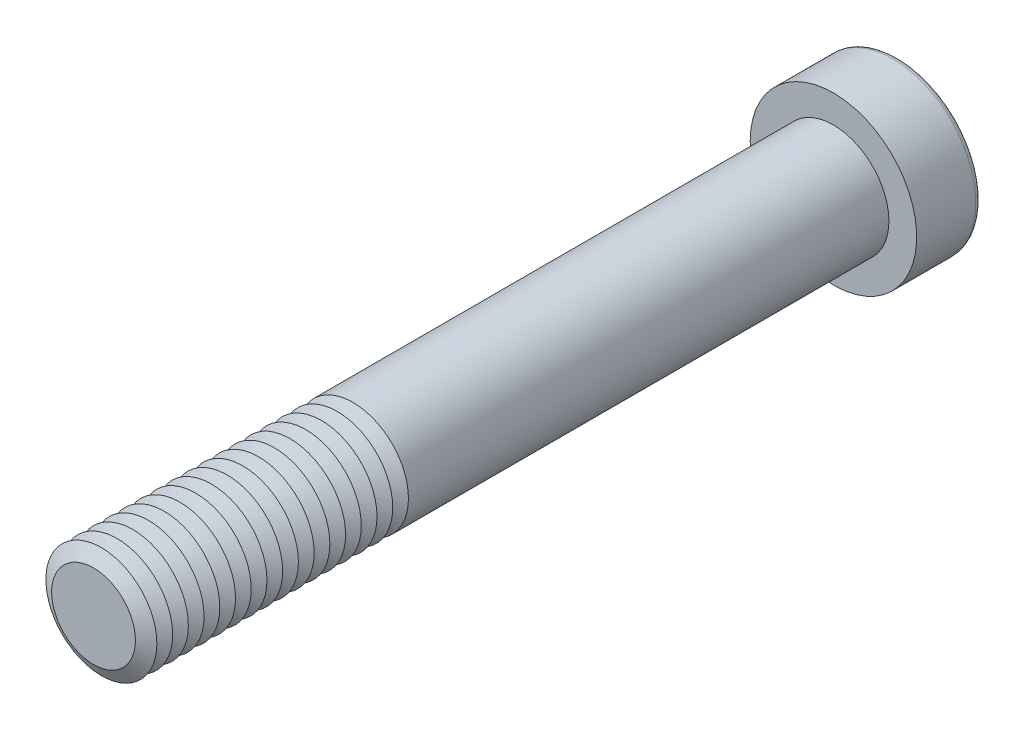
from build123d import *

# Parameters (mm, degrees)
SKETCH1_R           = 6
BOSS_EXTRUDE1_DEPTH = 80
SKETCH2_R           = 9
BOSS_EXTRUDE2_DEPTH = 7
CUT_EXTRUDE1_DEPTH  = 6
FILLET1_R           = 0.6
LPATTERN1_COUNT     = 17
LPATTERN1_PITCH     = 1.7


with BuildPart() as part:
    # Sketch1 → Boss-Extrude1 (new body)
    with BuildSketch(Plane.XY):
        Circle(SKETCH1_R)
    extrude(amount=BOSS_EXTRUDE1_DEPTH)

    # Sketch2 → Boss-Extrude2 (add)
    with BuildSketch(Plane(origin=(0, 0, 0), x_dir=(-1, 0, 0), z_dir=(0, 0, -1))):
        Circle(SKETCH2_R)
    extrude(amount=BOSS_EXTRUDE2_DEPTH)

    # Sketch3 → Cut-Extrude1 (cut)
    with BuildSketch(Plane(origin=(0, 0, -7), x_dir=(-1, 0, 0), z_dir=(0, 0, -1))):
        Polygon((-2.309401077, 4), (-4.618802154, 0), (-2.309401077, -4), (2.309401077, -4), (4.618802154, 0), (2.309401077, 4), align=None)
    extrude(amount=-CUT_EXTRUDE1_DEPTH, mode=Mode.SUBTRACT)

    # Fillet1
    fillet1_edges = [part.edges().sort_by_distance(p)[0] for p in [
        (9, 0, -7),
    ]]
    fillet(fillet1_edges, radius=FILLET1_R)

    # Cut-Extrude2 cone 1 section (on through the dimple's axis) → Cut-Extrude2 (revolve, cut)
    with BuildSketch(Plane(origin=(0, 0, -1), x_dir=(0, 1, 0), z_dir=(1, 0, 0))):
        Polygon((0, 0), (4, 0), (0, 2.309401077), align=None)
    revolve(axis=Axis((0, 0, -1), (0, 0, 1)), mode=Mode.SUBTRACT)

    # Cut-Extrude3 cone 1 section (on through the dimple's axis) → Cut-Extrude3 (revolve, cut)
    with BuildSketch(Plane(origin=(0, 0, -7), x_dir=(0, 1, 0), z_dir=(1, 0, 0))):
        Polygon((0, 0), (4.618802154, 0), (0, 1.237604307), align=None)
    revolve(axis=Axis((0, 0, -7), (0, 0, 1)), mode=Mode.SUBTRACT)

    # Sketch7 → Cut-Revolve1 (revolve, cut)
    with BuildSketch(Plane(origin=(0, 0, 0), x_dir=(0, 0, -1), z_dir=(1, 0, 0)), mode=Mode.PRIVATE) as cut_revolve1_sk:
        Polygon((-80, 4.527756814), (-79.15, 6), (-80.85, 6), align=None)
    cut_revolve1 = revolve(cut_revolve1_sk.sketch.rotate(Axis((0, 0, 80), (0, 0, -1)), 90), axis=Axis((0, 0, 80), (0, 0, -1)), mode=Mode.SUBTRACT)

    # LPattern1: Cut-Revolve1 ×17
    with Locations(*[(0, 0, -i * LPATTERN1_PITCH) for i in range(1, LPATTERN1_COUNT)]):
        add(cut_revolve1, mode=Mode.SUBTRACT)


solid = part.part
